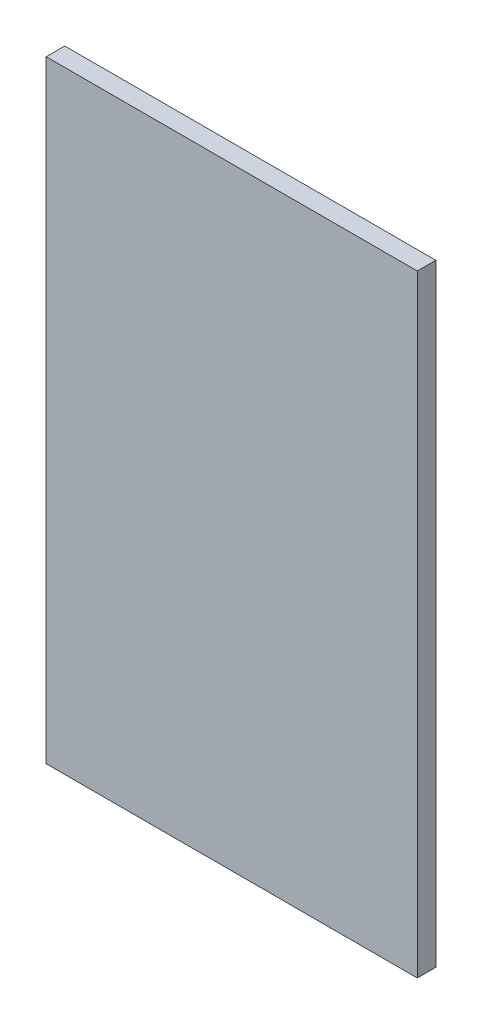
ISO-10303-21;
HEADER;
FILE_DESCRIPTION(('STEP AP214'),'2;1');
FILE_NAME('part.step','',(''),(''),'','','');
FILE_SCHEMA(('AUTOMOTIVE_DESIGN { 1 0 10303 214 1 1 1 1 }'));
ENDSEC;
DATA;
#1=APPLICATION_CONTEXT('core data for automotive mechanical design processes');
#2=APPLICATION_PROTOCOL_DEFINITION('international standard','automotive_design',2000,#1);
#3=PRODUCT_CONTEXT('',#1,'mechanical');
#4=PRODUCT('Part','Part','',(#3));
#5=PRODUCT_RELATED_PRODUCT_CATEGORY('part','',(#4));
#6=PRODUCT_DEFINITION_FORMATION('','',#4);
#7=PRODUCT_DEFINITION_CONTEXT('part definition',#1,'design');
#8=PRODUCT_DEFINITION('design','',#6,#7);
#9=PRODUCT_DEFINITION_SHAPE('','',#8);
#10=(LENGTH_UNIT() NAMED_UNIT(*) SI_UNIT(.MILLI.,.METRE.));
#11=(NAMED_UNIT(*) PLANE_ANGLE_UNIT() SI_UNIT($,.RADIAN.));
#12=(NAMED_UNIT(*) SI_UNIT($,.STERADIAN.) SOLID_ANGLE_UNIT());
#13=UNCERTAINTY_MEASURE_WITH_UNIT(LENGTH_MEASURE(1.E-05),#10,'distance_accuracy_value','');
#14=(GEOMETRIC_REPRESENTATION_CONTEXT(3) GLOBAL_UNCERTAINTY_ASSIGNED_CONTEXT((#13)) GLOBAL_UNIT_ASSIGNED_CONTEXT((#10,
#11,#12)) REPRESENTATION_CONTEXT('',''));
#15=CARTESIAN_POINT('',(0.,0.,0.));
#16=DIRECTION('',(0.,0.,1.));
#17=DIRECTION('',(1.,0.,0.));
#18=AXIS2_PLACEMENT_3D('',#15,#16,#17);
#19=CARTESIAN_POINT('',(-19.5513698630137,19.2123287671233,1.));
#20=DIRECTION('',(1.,0.,0.));
#21=DIRECTION('',(0.,0.,-1.));
#22=AXIS2_PLACEMENT_3D('',#19,#20,#21);
#23=PLANE('',#22);
#24=DIRECTION('',(0.,-1.,0.));
#25=VECTOR('',#24,1.);
#26=CARTESIAN_POINT('',(-19.5513698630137,19.2123287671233,0.));
#27=LINE('',#26,#25);
#28=CARTESIAN_POINT('',(-19.5513698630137,19.2123287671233,0.));
#29=VERTEX_POINT('',#28);
#30=CARTESIAN_POINT('',(-19.5513698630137,-13.7876712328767,0.));
#31=VERTEX_POINT('',#30);
#32=EDGE_CURVE('E96',#29,#31,#27,.T.);
#33=ORIENTED_EDGE('',*,*,#32,.T.);
#34=DIRECTION('',(0.,0.,-1.));
#35=VECTOR('',#34,1.);
#36=CARTESIAN_POINT('',(-19.5513698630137,-13.7876712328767,1.));
#37=LINE('',#36,#35);
#38=CARTESIAN_POINT('',(-19.5513698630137,-13.7876712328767,1.));
#39=VERTEX_POINT('',#38);
#40=EDGE_CURVE('E11',#39,#31,#37,.T.);
#41=ORIENTED_EDGE('',*,*,#40,.F.);
#42=DIRECTION('',(0.,-1.,0.));
#43=VECTOR('',#42,1.);
#44=CARTESIAN_POINT('',(-19.5513698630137,19.2123287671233,1.));
#45=LINE('',#44,#43);
#46=CARTESIAN_POINT('',(-19.5513698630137,19.2123287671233,1.));
#47=VERTEX_POINT('',#46);
#48=EDGE_CURVE('E84',#47,#39,#45,.T.);
#49=ORIENTED_EDGE('',*,*,#48,.F.);
#50=DIRECTION('',(0.,0.,-1.));
#51=VECTOR('',#50,1.);
#52=CARTESIAN_POINT('',(-19.5513698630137,19.2123287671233,1.));
#53=LINE('',#52,#51);
#54=EDGE_CURVE('E92',#47,#29,#53,.T.);
#55=ORIENTED_EDGE('',*,*,#54,.T.);
#56=EDGE_LOOP('',(#33,#41,#49,#55));
#57=FACE_BOUND('',#56,.T.);
#58=ADVANCED_FACE('F33',(#57),#23,.F.);
#59=CARTESIAN_POINT('',(-19.5513698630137,-13.7876712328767,1.));
#60=DIRECTION('',(0.,1.,0.));
#61=DIRECTION('',(-1.,0.,0.));
#62=AXIS2_PLACEMENT_3D('',#59,#60,#61);
#63=PLANE('',#62);
#64=DIRECTION('',(1.,0.,0.));
#65=VECTOR('',#64,1.);
#66=CARTESIAN_POINT('',(-19.5513698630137,-13.7876712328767,0.));
#67=LINE('',#66,#65);
#68=CARTESIAN_POINT('',(0.448630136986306,-13.7876712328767,0.));
#69=VERTEX_POINT('',#68);
#70=EDGE_CURVE('E88',#31,#69,#67,.T.);
#71=ORIENTED_EDGE('',*,*,#70,.T.);
#72=DIRECTION('',(0.,0.,-1.));
#73=VECTOR('',#72,1.);
#74=CARTESIAN_POINT('',(0.448630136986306,-13.7876712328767,1.));
#75=LINE('',#74,#73);
#76=CARTESIAN_POINT('',(0.448630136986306,-13.7876712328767,1.));
#77=VERTEX_POINT('',#76);
#78=EDGE_CURVE('E41',#77,#69,#75,.T.);
#79=ORIENTED_EDGE('',*,*,#78,.F.);
#80=DIRECTION('',(1.,0.,0.));
#81=VECTOR('',#80,1.);
#82=CARTESIAN_POINT('',(-19.5513698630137,-13.7876712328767,1.));
#83=LINE('',#82,#81);
#84=EDGE_CURVE('E79',#39,#77,#83,.T.);
#85=ORIENTED_EDGE('',*,*,#84,.F.);
#86=ORIENTED_EDGE('',*,*,#40,.T.);
#87=EDGE_LOOP('',(#71,#79,#85,#86));
#88=FACE_BOUND('',#87,.T.);
#89=ADVANCED_FACE('F87',(#88),#63,.F.);
#90=CARTESIAN_POINT('',(0.448630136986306,19.2123287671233,1.));
#91=DIRECTION('',(-1.,0.,0.));
#92=DIRECTION('',(0.,0.,1.));
#93=AXIS2_PLACEMENT_3D('',#90,#91,#92);
#94=PLANE('',#93);
#95=DIRECTION('',(0.,1.,0.));
#96=VECTOR('',#95,1.);
#97=CARTESIAN_POINT('',(0.448630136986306,19.2123287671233,0.));
#98=LINE('',#97,#96);
#99=CARTESIAN_POINT('',(0.448630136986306,19.2123287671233,0.));
#100=VERTEX_POINT('',#99);
#101=EDGE_CURVE('E66',#69,#100,#98,.T.);
#102=ORIENTED_EDGE('',*,*,#101,.T.);
#103=DIRECTION('',(0.,0.,-1.));
#104=VECTOR('',#103,1.);
#105=CARTESIAN_POINT('',(0.448630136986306,19.2123287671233,1.));
#106=LINE('',#105,#104);
#107=CARTESIAN_POINT('',(0.448630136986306,19.2123287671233,1.));
#108=VERTEX_POINT('',#107);
#109=EDGE_CURVE('E89',#108,#100,#106,.T.);
#110=ORIENTED_EDGE('',*,*,#109,.F.);
#111=DIRECTION('',(0.,1.,0.));
#112=VECTOR('',#111,1.);
#113=CARTESIAN_POINT('',(0.448630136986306,19.2123287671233,1.));
#114=LINE('',#113,#112);
#115=EDGE_CURVE('E82',#77,#108,#114,.T.);
#116=ORIENTED_EDGE('',*,*,#115,.F.);
#117=ORIENTED_EDGE('',*,*,#78,.T.);
#118=EDGE_LOOP('',(#102,#110,#116,#117));
#119=FACE_BOUND('',#118,.T.);
#120=ADVANCED_FACE('F90',(#119),#94,.F.);
#121=CARTESIAN_POINT('',(-19.5513698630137,19.2123287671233,1.));
#122=DIRECTION('',(0.,-1.,0.));
#123=DIRECTION('',(0.,0.,-1.));
#124=AXIS2_PLACEMENT_3D('',#121,#122,#123);
#125=PLANE('',#124);
#126=DIRECTION('',(-1.,0.,0.));
#127=VECTOR('',#126,1.);
#128=CARTESIAN_POINT('',(-19.5513698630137,19.2123287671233,0.));
#129=LINE('',#128,#127);
#130=EDGE_CURVE('E72',#100,#29,#129,.T.);
#131=ORIENTED_EDGE('',*,*,#130,.T.);
#132=ORIENTED_EDGE('',*,*,#54,.F.);
#133=DIRECTION('',(-1.,0.,0.));
#134=VECTOR('',#133,1.);
#135=CARTESIAN_POINT('',(-19.5513698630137,19.2123287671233,1.));
#136=LINE('',#135,#134);
#137=EDGE_CURVE('E49',#108,#47,#136,.T.);
#138=ORIENTED_EDGE('',*,*,#137,.F.);
#139=ORIENTED_EDGE('',*,*,#109,.T.);
#140=EDGE_LOOP('',(#131,#132,#138,#139));
#141=FACE_BOUND('',#140,.T.);
#142=ADVANCED_FACE('F103',(#141),#125,.F.);
#143=CARTESIAN_POINT('',(0.,0.,1.));
#144=DIRECTION('',(0.,0.,1.));
#145=DIRECTION('',(1.,0.,0.));
#146=AXIS2_PLACEMENT_3D('',#143,#144,#145);
#147=PLANE('',#146);
#148=ORIENTED_EDGE('',*,*,#48,.T.);
#149=ORIENTED_EDGE('',*,*,#84,.T.);
#150=ORIENTED_EDGE('',*,*,#115,.T.);
#151=ORIENTED_EDGE('',*,*,#137,.T.);
#152=EDGE_LOOP('',(#148,#149,#150,#151));
#153=FACE_BOUND('',#152,.T.);
#154=ADVANCED_FACE('F80',(#153),#147,.T.);
#155=CARTESIAN_POINT('',(0.,0.,0.));
#156=DIRECTION('',(0.,0.,1.));
#157=DIRECTION('',(1.,0.,0.));
#158=AXIS2_PLACEMENT_3D('',#155,#156,#157);
#159=PLANE('',#158);
#160=ORIENTED_EDGE('',*,*,#32,.F.);
#161=ORIENTED_EDGE('',*,*,#130,.F.);
#162=ORIENTED_EDGE('',*,*,#101,.F.);
#163=ORIENTED_EDGE('',*,*,#70,.F.);
#164=EDGE_LOOP('',(#160,#161,#162,#163));
#165=FACE_BOUND('',#164,.T.);
#166=ADVANCED_FACE('F106',(#165),#159,.F.);
#167=CLOSED_SHELL('',(#58,#89,#120,#142,#154,#166));
#168=MANIFOLD_SOLID_BREP('B2',#167);
#169=ADVANCED_BREP_SHAPE_REPRESENTATION('',(#18,#168),#14);
#170=SHAPE_DEFINITION_REPRESENTATION(#9,#169);
ENDSEC;
END-ISO-10303-21;
